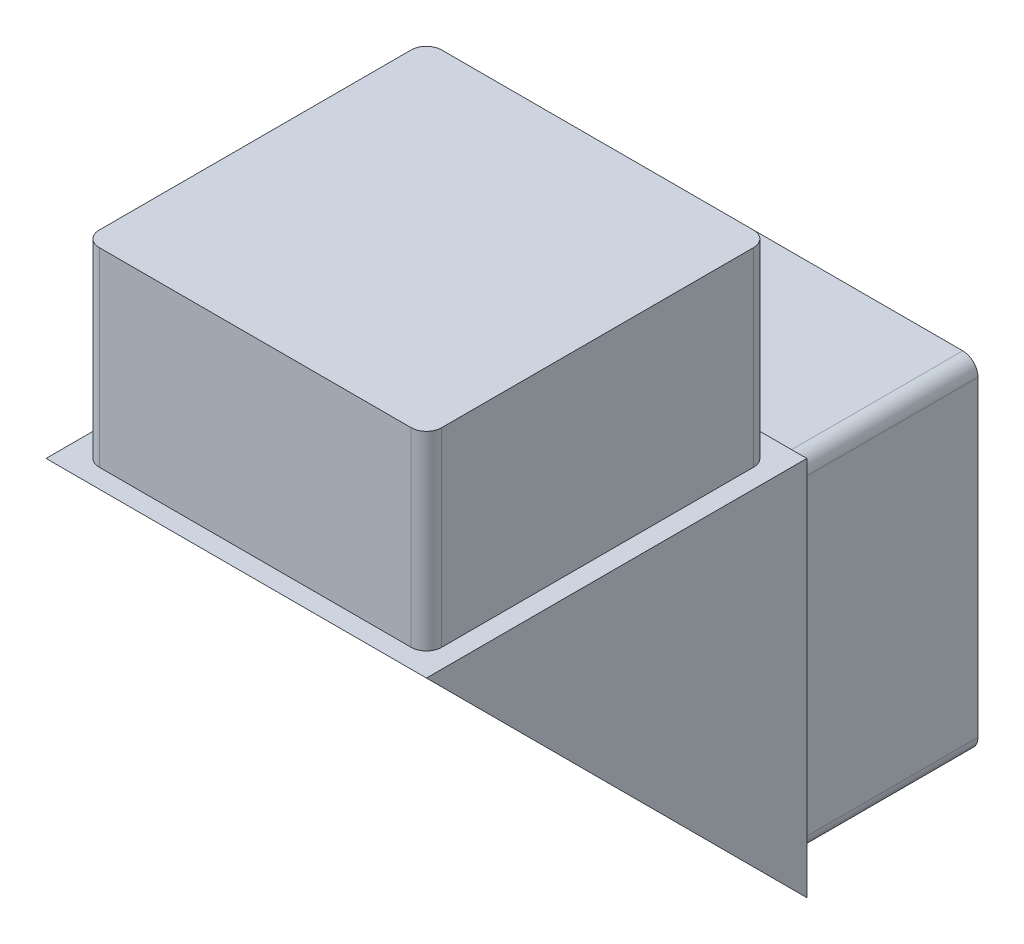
from build123d import *

# Parameters (mm, degrees)
SKETCH_1_W          = 20
SKETCH_1_H          = 20
EXTRUDE_1_DEPTH     = 10
CUT_EXTRUDE_2_DEPTH = 25.494897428
SKETCH_3_W          = 18
SKETCH_3_H          = 18
EXTRUDE_3_DEPTH     = 10
SKETCH_4_W          = 18
SKETCH_4_H          = 18
EXTRUDE_4_DEPTH     = 10
FILLET_1_R          = 0.8


with BuildPart() as part:
    # Sketch 1 → Extrude 1 (new, symmetric)
    with BuildSketch(Plane(origin=(0, 0, 0), x_dir=(1, 0, 0), z_dir=(0, 1, 0))):
        Rectangle(SKETCH_1_W, SKETCH_1_H)
    extrude(amount=EXTRUDE_1_DEPTH, both=True)

    # Sketch 2 → Cut-Extrude 2 (cut, through all)
    with BuildSketch(Plane(origin=(10, 0, 0), x_dir=(0, 0, -1), z_dir=(1, 0, 0))):
        Polygon((-10, 10), (10, -10), (-10, -10), align=None)
    extrude(amount=-CUT_EXTRUDE_2_DEPTH, mode=Mode.SUBTRACT)

    # Sketch 3 → Extrude 3 (add)
    with BuildSketch(Plane(origin=(0, 0, -10), x_dir=(-1, 0, 0), z_dir=(0, 0, -1))):
        Rectangle(SKETCH_3_W, SKETCH_3_H)
    extrude(amount=EXTRUDE_3_DEPTH)

    # Sketch 4 → Extrude 4 (add)
    with BuildSketch(Plane(origin=(0, 10, 0), x_dir=(1, 0, 0), z_dir=(0, 1, 0))):
        Rectangle(SKETCH_4_W, SKETCH_4_H)
    extrude(amount=EXTRUDE_4_DEPTH)

    # Fillet 1
    fillet_1_edges = [part.edges().sort_by_distance(p)[0] for p in [
        (-9, -9, -15),
        (-9, 9, -15),
        (9, 9, -15),
        (9, -9, -15),
        (9, 15, 9),
        (9, 15, -9),
        (-9, 15, -9),
        (-9, 15, 9),
    ]]
    fillet(fillet_1_edges, radius=FILLET_1_R)


solid = part.part
